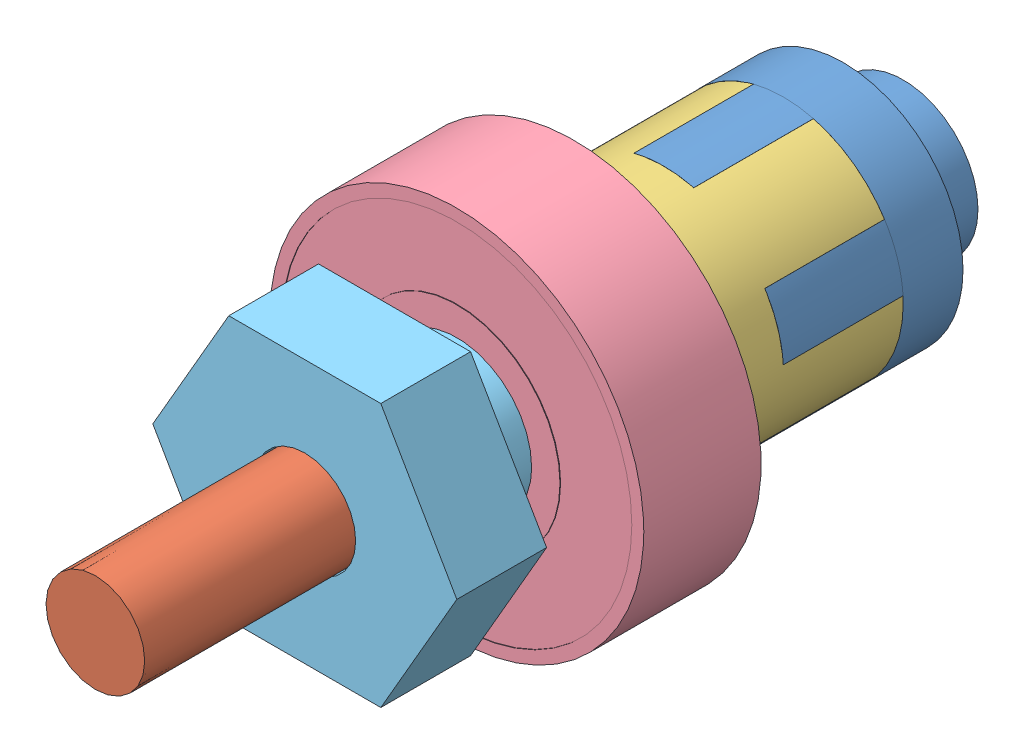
SolidWorks assembly Assem2.sldasm, configuration Default (file format 10000). Lengths in mm.
Overall size (15.88 15.88 34.29).
5 component instances, 5 part files, 10 mates.
Components (placement in the parent):
- Rear Axle Part 2-1: Rear Axle Part 2.SLDPRT [Default] at (7.8729 7.2951 -0.786) size (10.16 10.16 10.16)
- 8-32 1-1: 8-32 1.SLDPRT [Default] at (7.8729 7.2951 8.358) x (-0.505802 -0.86265 0) z (0 0 -1) size (6.86 6.86 29.21)
- Rear Axle Part 3-1: Rear Axle Part 3.SLDPRT [Default] at (7.8729 7.2951 11.914) size (10.16 10.16 11.43)
- Bearing-1: Bearing.SLDPRT [Default] at (7.8729 7.2951 15.6732) size (15.88 15.88 4.98)
- Wheel Mount-1: Wheel Mount.SLDPRT [Default] at (7.8729 7.2951 20.804) size (12.9 11.18 13.97)
Mates (geometry in assembly coordinates):
- Concentric3: concentric aligned: cylinder of Rear Axle Part 2-1 through (7.8729 7.2951 6.834) axis (0 0 -1) radius 1.524; cylinder of 8-32 1-1 through (7.8729 7.2951 33.504) axis (0 0 -1) radius 2.0955
- Coincident1: coincident anti-aligned: plane of Rear Axle Part 2-1 through (7.8729 7.2951 6.834) normal (0 0 1); plane of 8-32 1-1 through (7.8729 7.2951 6.834) normal (0 0 -1)
- Concentric4: concentric aligned: cylinder of 8-32 1-1 through (7.8729 7.2951 33.504) axis (0 0 -1) radius 2.0955; cylinder of Rear Axle Part 3-1 through (7.8729 7.2951 13.184) axis (0 0 -1) radius 3.175
- Coincident2: coincident anti-aligned: plane of Rear Axle Part 2-1 through (6.6029 12.2166 9.374) normal (-1 0 0); plane of Rear Axle Part 3-1 through (6.6029 7.2951 9.374) normal (1 0 0)
- Coincident3: coincident anti-aligned: plane of Rear Axle Part 2-1 through (7.8729 7.2951 4.294) normal (0 0 1); plane of Rear Axle Part 3-1 through (7.8729 7.2951 4.294) normal (0 0 -1)
- Concentric5: concentric aligned: cylinder of Rear Axle Part 3-1 through (7.8729 7.2951 15.724) axis (0 0 -1) radius 3.175; cylinder of Bearing-1 through (7.8729 7.2951 18.1624) axis (0 0 -1) radius 3.175
- Coincident4: coincident anti-aligned: plane of Rear Axle Part 3-1 through (7.8729 7.2951 13.184) normal (0 0 1); plane of Bearing-1 through (7.8729 7.2951 13.184) normal (0 0 -1)
- Concentric6: concentric anti-aligned: cylinder of 8-32 1-1 through (7.8729 7.2951 33.504) axis (0 0 -1) radius 2.0955; cylinder of Wheel Mount-1 through (7.8729 7.2951 20.804) axis (0 0 1) radius 2.159
- Coincident5: coincident anti-aligned: plane of Rear Axle Part 3-1 through (6.6029 7.2951 13.184) normal (1 0 0); plane of Wheel Mount-1 through (6.6029 10.2051 10.644) normal (-1 0 0)
- Coincident6: coincident anti-aligned: plane of Rear Axle Part 3-1 through (7.8729 7.2951 10.644) normal (0 0 1); plane of Wheel Mount-1 through (7.8729 7.2951 10.644) normal (0 0 -1)
